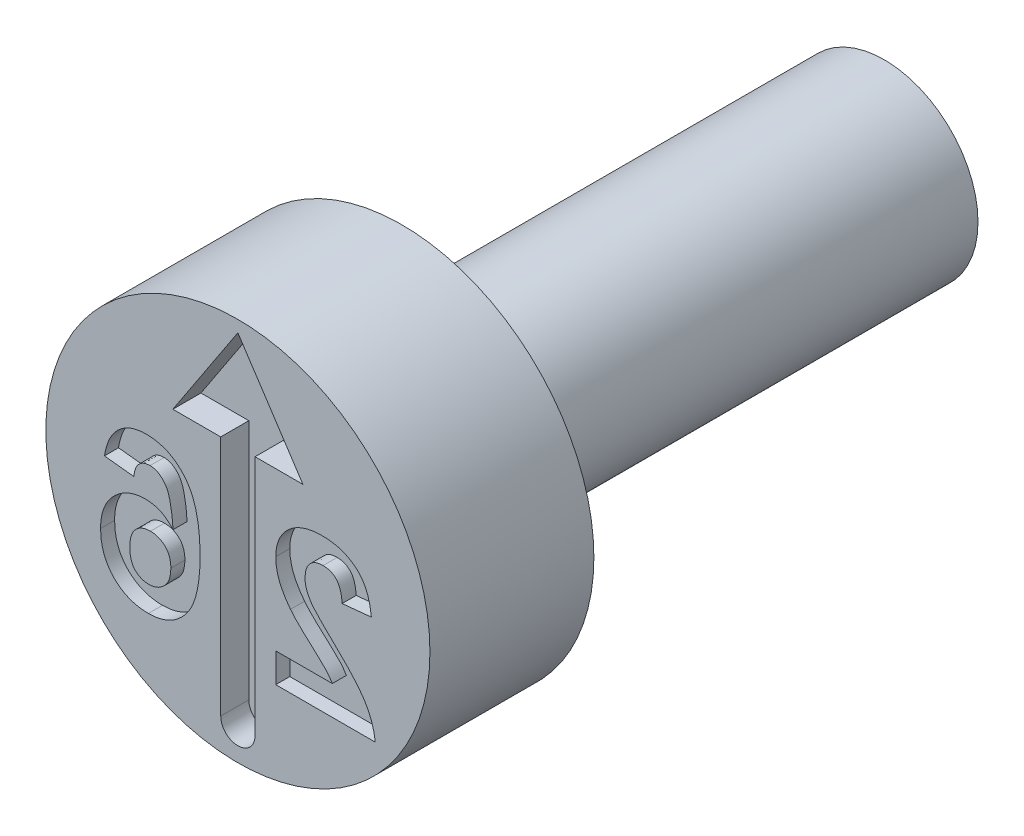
from build123d import *

# Parameters (mm, degrees)
CUT_EXTRUDE4_DEPTH = 0.6
CUT_EXTRUDE5_DEPTH = 0.3


with BuildPart() as part:
    # Sketch2 → Revolve1 (revolve)
    with BuildSketch(Plane(origin=(0, 0, 0), x_dir=(0, 0, -1), z_dir=(1, 0, 0)), mode=Mode.PRIVATE) as revolve1_sk:
        Polygon((0, 4.1), (0, 0), (13.8, 0), (13.8, 2), (3.5, 2), (3.5, 4.1), align=None)
    revolve(revolve1_sk.sketch.rotate(Axis((0, 0, -0.403888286), (0, 0, -1)), 90), axis=Axis((0, 0, -0.403888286), (0, 0, -1)))

    # Sketch3 → Cut-Extrude4 (cut)
    with BuildSketch(Plane.XY):
        with BuildLine():
            Line((0.366422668, 1.743593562), (0.366422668, -3.416891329))
            ThreePointArc((0.366422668, -3.416891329), (0, -3.783313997), (-0.366422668, -3.416891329))
            Line((-0.366422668, -3.416891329), (-0.366422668, 1.743593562))
            Line((-0.366422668, 1.743593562), (-1.388789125, 1.743593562))
            Line((-1.388789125, 1.743593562), (0, 3.851569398))
            Line((0, 3.851569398), (1.388789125, 1.743593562))
            Line((1.388789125, 1.743593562), (0.366422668, 1.743593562))
        make_face()
    extrude(amount=-CUT_EXTRUDE4_DEPTH, mode=Mode.SUBTRACT)

    # Sketch4 → Cut-Extrude5 (cut)
    # profile 1 of 2: a face of its own
    with BuildSketch(Plane.XY):
        with BuildLine():
            Line((0.808333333, -1.625), (0.808333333, -2.25))
            Line((0.808333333, -2.25), (2.933333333, -2.25))
            add(Edge.make_bspline(
                [(2.933333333, -2.25), (2.926138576, -2.196584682), (2.911753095, -2.089783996), (2.86727833, -1.933775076), (2.807919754, -1.781537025), (2.743497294, -1.657652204), (2.679422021, -1.557929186), (2.621286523, -1.476215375), (2.551933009, -1.389275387), (2.472367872, -1.296407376), (2.383030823, -1.197321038), (2.283255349, -1.092384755), (2.172565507, -0.982100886), (2.094693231, -0.907212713), (2.054427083, -0.868489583)],
                knots=[0, 0, 0, 0, 1.156289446, 2.311930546, 3.473459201, 4.661751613, 5.303057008, 6.018253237, 6.81459331, 7.690699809, 8.644447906, 9.679642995, 10.800191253, 12, 12, 12, 12], degree=3))
            add(Edge.make_bspline(
                [(2.054427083, -0.868489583), (2.022294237, -0.837472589), (1.961122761, -0.778425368), (1.874014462, -0.693872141), (1.79743729, -0.616143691), (1.729790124, -0.547254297), (1.672635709, -0.48544986), (1.625222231, -0.431701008), (1.586949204, -0.385788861), (1.5662205, -0.356662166), (1.55703125, -0.34375)],
                knots=[0, 0, 0, 0, 1.480720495, 2.818855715, 4.024636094, 5.098235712, 6.019786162, 6.815086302, 7.474715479, 8, 8, 8, 8], degree=3))
            add(Edge.make_bspline(
                [(1.55703125, -0.34375), (1.53821391, -0.312492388), (1.501917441, -0.252200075), (1.462115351, -0.157389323), (1.438224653, -0.062598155), (1.434946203, 0.000740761), (1.433333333, 0.031901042)],
                knots=[0, 0, 0, 0, 1.0911822, 2.104764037, 3.067617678, 4, 4, 4, 4], degree=3))
            add(Edge.make_bspline(
                [(1.433333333, 0.031901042), (1.434503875, 0.064327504), (1.436718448, 0.12567584), (1.455288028, 0.212249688), (1.488218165, 0.286672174), (1.533556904, 0.349171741), (1.59088783, 0.398139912), (1.657909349, 0.434322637), (1.73560255, 0.454326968), (1.790209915, 0.456958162), (1.81875, 0.458333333)],
                knots=[0, 0, 0, 0, 1.193122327, 2.257294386, 3.237245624, 4.168877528, 5.075331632, 5.990371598, 6.949684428, 8, 8, 8, 8], degree=3))
            add(Edge.make_bspline(
                [(1.81875, 0.458333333), (1.847097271, 0.457049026), (1.901858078, 0.454568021), (1.979685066, 0.432894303), (2.047769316, 0.395374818), (2.096289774, 0.352617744), (2.129067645, 0.311039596), (2.151401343, 0.274806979), (2.170651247, 0.233635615), (2.187708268, 0.187989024), (2.201181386, 0.137344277), (2.212031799, 0.082087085), (2.220775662, 0.021920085), (2.223556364, -0.019936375), (2.225, -0.041666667)],
                knots=[0, 0, 0, 0, 1.402788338, 2.709884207, 3.961032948, 5.225417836, 5.883680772, 6.578928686, 7.329201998, 8.132101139, 8.990263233, 9.922304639, 10.921339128, 12, 12, 12, 12], degree=3))
            Line((2.225, -0.041666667), (2.85, 0.01953125))
            add(Edge.make_bspline(
                [(2.85, 0.01953125), (2.844975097, 0.061726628), (2.835232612, 0.143536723), (2.810920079, 0.261044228), (2.780129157, 0.369450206), (2.741391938, 0.468553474), (2.696309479, 0.558984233), (2.6425822, 0.639385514), (2.582087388, 0.710647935), (2.514772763, 0.772733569), (2.441066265, 0.825839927), (2.363724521, 0.8732455), (2.281236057, 0.91213314), (2.194509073, 0.944182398), (2.103582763, 0.969795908), (2.008036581, 0.986731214), (1.908460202, 0.998643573), (1.84048895, 0.999541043), (1.805729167, 1)],
                knots=[0, 0, 0, 0, 1.270971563, 2.464210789, 3.586263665, 4.638946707, 5.643716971, 6.603612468, 7.52484387, 8.434700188, 9.336036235, 10.239171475, 11.145359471, 12.059630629, 13.003312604, 13.96741569, 14.960557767, 16, 16, 16, 16], degree=3))
            add(Edge.make_bspline(
                [(1.805729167, 1), (1.767940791, 0.999273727), (1.694343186, 0.997859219), (1.586903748, 0.986178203), (1.485972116, 0.965810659), (1.390665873, 0.938830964), (1.301963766, 0.902811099), (1.219126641, 0.859264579), (1.14345821, 0.806538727), (1.073830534, 0.747508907), (1.011588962, 0.682595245), (0.957070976, 0.61335385), (0.911395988, 0.539832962), (0.873067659, 0.462928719), (0.844609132, 0.381403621), (0.823873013, 0.296384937), (0.810124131, 0.207476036), (0.808936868, 0.146753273), (0.808333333, 0.115885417)],
                knots=[0, 0, 0, 0, 1.210756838, 2.35810096, 3.457354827, 4.507168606, 5.527358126, 6.519769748, 7.499700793, 8.476517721, 9.440526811, 10.376769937, 11.295256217, 12.209626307, 13.124630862, 14.055668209, 15.011616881, 16, 16, 16, 16], degree=3))
            add(Edge.make_bspline(
                [(0.808333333, 0.115885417), (0.809128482, 0.080458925), (0.810705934, 0.010178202), (0.82580887, -0.093717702), (0.848883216, -0.195217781), (0.882985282, -0.294570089), (0.926212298, -0.39415786), (0.981932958, -0.494204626), (1.046628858, -0.59772762), (1.097283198, -0.664659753), (1.1234375, -0.69921875)],
                knots=[0, 0, 0, 0, 0.953409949, 1.89141903, 2.821310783, 3.752688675, 4.715703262, 5.740811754, 6.833515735, 8, 8, 8, 8], degree=3))
            add(Edge.make_bspline(
                [(1.1234375, -0.69921875), (1.133322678, -0.711669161), (1.154494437, -0.738335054), (1.190513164, -0.779223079), (1.23225577, -0.823885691), (1.279132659, -0.873158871), (1.332692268, -0.925297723), (1.391007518, -0.982482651), (1.45664445, -1.041788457), (1.524628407, -1.104694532), (1.592907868, -1.165920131), (1.655666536, -1.224070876), (1.71267229, -1.275521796), (1.761270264, -1.323113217), (1.804318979, -1.36359706), (1.840266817, -1.399049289), (1.869786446, -1.428611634), (1.910462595, -1.474691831), (1.962218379, -1.537015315), (1.998630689, -1.596567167), (2.016015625, -1.625)],
                knots=[0, 0, 0, 0, 0.665555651, 1.425465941, 2.280616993, 3.225313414, 4.272635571, 5.410053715, 6.644756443, 7.976022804, 9.288331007, 10.484517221, 11.558462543, 12.503158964, 13.33222979, 14.032602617, 14.617328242, 15.080653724, 16.606167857, 18, 18, 18, 18], degree=3))
            Line((2.016015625, -1.625), (0.808333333, -1.625))
        make_face()
    # profile 2 of 2: a face of its own
    with BuildSketch(Plane.XY):
        with BuildLine():
            Line((-2.848333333, 0.151692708), (-2.223333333, 0.083333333))
            add(Edge.make_bspline(
                [(-2.223333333, 0.083333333), (-2.219146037, 0.113436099), (-2.21126631, 0.170084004), (-2.187926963, 0.248258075), (-2.155435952, 0.314022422), (-2.11373059, 0.367468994), (-2.06405511, 0.408603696), (-2.007452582, 0.43783241), (-1.943958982, 0.455183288), (-1.899443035, 0.457256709), (-1.876328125, 0.458333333)],
                knots=[0, 0, 0, 0, 1.280716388, 2.410074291, 3.425374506, 4.35753932, 5.248331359, 6.12451615, 7.026154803, 8, 8, 8, 8], degree=3))
            add(Edge.make_bspline(
                [(-1.876328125, 0.458333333), (-1.860653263, 0.457950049), (-1.82946108, 0.457187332), (-1.784025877, 0.447503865), (-1.740220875, 0.433133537), (-1.698403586, 0.412780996), (-1.658365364, 0.386519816), (-1.620714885, 0.354036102), (-1.583721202, 0.317042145), (-1.54956173, 0.272370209), (-1.516789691, 0.219475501), (-1.488571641, 0.154722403), (-1.463420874, 0.078171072), (-1.441886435, -0.010553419), (-1.422344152, -0.110887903), (-1.406325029, -0.223238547), (-1.393506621, -0.347706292), (-1.387357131, -0.434874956), (-1.384140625, -0.48046875)],
                knots=[0, 0, 0, 0, 0.642458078, 1.278459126, 1.898279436, 2.531842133, 3.181731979, 3.858193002, 4.57010051, 5.325711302, 6.161524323, 7.118599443, 8.217371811, 9.466325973, 10.864147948, 12.412648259, 14.123626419, 16, 16, 16, 16], degree=3))
            add(Edge.make_bspline(
                [(-1.384140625, -0.48046875), (-1.40411571, -0.458773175), (-1.443284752, -0.416230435), (-1.508278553, -0.360764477), (-1.57636923, -0.313344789), (-1.648297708, -0.274441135), (-1.724456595, -0.245490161), (-1.803466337, -0.223508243), (-1.886361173, -0.211195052), (-1.942696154, -0.209298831), (-1.971380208, -0.208333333)],
                knots=[0, 0, 0, 0, 1.057745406, 2.074127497, 3.059409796, 4.031705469, 5.000875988, 5.977809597, 6.970362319, 8, 8, 8, 8], degree=3))
            add(Edge.make_bspline(
                [(-1.971380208, -0.208333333), (-2.003752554, -0.209265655), (-2.067676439, -0.21110666), (-2.161851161, -0.224019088), (-2.252217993, -0.247237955), (-2.339185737, -0.278647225), (-2.423184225, -0.318199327), (-2.502606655, -0.368266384), (-2.578699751, -0.426642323), (-2.650417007, -0.493336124), (-2.716307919, -0.566760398), (-2.774483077, -0.646064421), (-2.822359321, -0.731490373), (-2.863287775, -0.821125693), (-2.893740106, -0.916739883), (-2.91584528, -1.016957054), (-2.929040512, -1.122697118), (-2.930777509, -1.194840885), (-2.931666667, -1.231770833)],
                knots=[0, 0, 0, 0, 0.99135015, 1.957564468, 2.903754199, 3.843479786, 4.78583385, 5.741106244, 6.712813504, 7.719198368, 8.735844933, 9.730198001, 10.724351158, 11.729813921, 12.742848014, 13.790983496, 14.86921809, 16, 16, 16, 16], degree=3))
            add(Edge.make_bspline(
                [(-2.931666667, -1.231770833), (-2.930764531, -1.270866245), (-2.92900515, -1.347111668), (-2.916054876, -1.458774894), (-2.89317919, -1.564172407), (-2.861926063, -1.664149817), (-2.821501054, -1.757914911), (-2.772529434, -1.846240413), (-2.713353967, -1.92761691), (-2.646660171, -2.003139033), (-2.572309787, -2.070532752), (-2.493073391, -2.130210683), (-2.408072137, -2.179819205), (-2.318562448, -2.22157327), (-2.223006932, -2.252215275), (-2.123090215, -2.275195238), (-2.017999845, -2.289210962), (-1.946249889, -2.290835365), (-1.90953125, -2.291666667)],
                knots=[0, 0, 0, 0, 1.13287417, 2.209376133, 3.25169942, 4.254157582, 5.240146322, 6.205890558, 7.174579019, 8.150183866, 9.1206468, 10.07783463, 11.019441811, 11.967766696, 12.934309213, 13.921380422, 14.936249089, 16, 16, 16, 16], degree=3))
            add(Edge.make_bspline(
                [(-1.90953125, -2.291666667), (-1.87018794, -2.29056595), (-1.792831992, -2.288401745), (-1.679591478, -2.270591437), (-1.571932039, -2.240459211), (-1.469867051, -2.198378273), (-1.372548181, -2.145446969), (-1.280879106, -2.079696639), (-1.195102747, -2.001754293), (-1.114084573, -1.91267545), (-1.040360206, -1.809782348), (-0.977575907, -1.690859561), (-0.92432853, -1.55720953), (-0.880977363, -1.408489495), (-0.847513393, -1.244711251), (-0.824162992, -1.065861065), (-0.808653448, -0.872234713), (-0.807344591, -0.738096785), (-0.806666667, -0.668619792)],
                knots=[0, 0, 0, 0, 0.852151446, 1.675481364, 2.476404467, 3.269281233, 4.062617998, 4.871616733, 5.707301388, 6.56955125, 7.476395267, 8.442009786, 9.475854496, 10.58877921, 11.794095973, 13.094195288, 14.494932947, 16, 16, 16, 16], degree=3))
            add(Edge.make_bspline(
                [(-0.806666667, -0.668619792), (-0.807638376, -0.597410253), (-0.809515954, -0.459816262), (-0.824624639, -0.261149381), (-0.848623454, -0.07768896), (-0.883583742, 0.090151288), (-0.928300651, 0.242719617), (-0.982512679, 0.380322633), (-1.047581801, 0.502462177), (-1.123234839, 0.608741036), (-1.206474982, 0.70112534), (-1.295916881, 0.780868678), (-1.391219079, 0.848742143), (-1.492379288, 0.904574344), (-1.60022795, 0.946900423), (-1.713742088, 0.977465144), (-1.833112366, 0.997108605), (-1.914879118, 0.999026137), (-1.95640625, 1)],
                knots=[0, 0, 0, 0, 1.491699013, 2.882321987, 4.171520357, 5.365488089, 6.470299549, 7.49861535, 8.458736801, 9.361983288, 10.224742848, 11.058789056, 11.867429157, 12.671146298, 13.473202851, 14.288259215, 15.130652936, 16, 16, 16, 16], degree=3))
            add(Edge.make_bspline(
                [(-1.95640625, 1), (-1.985738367, 0.9994723), (-2.043078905, 0.998440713), (-2.127119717, 0.987486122), (-2.20729387, 0.970734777), (-2.283811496, 0.947547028), (-2.356133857, 0.916494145), (-2.424548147, 0.878664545), (-2.48928436, 0.83416068), (-2.55000567, 0.783269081), (-2.606223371, 0.725835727), (-2.656986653, 0.661730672), (-2.702631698, 0.591727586), (-2.743358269, 0.515884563), (-2.777519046, 0.433475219), (-2.806885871, 0.345147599), (-2.831038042, 0.250711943), (-2.842480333, 0.185202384), (-2.848333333, 0.151692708)],
                knots=[0, 0, 0, 0, 1.036027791, 2.025301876, 2.989435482, 3.928225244, 4.845595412, 5.765526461, 6.686607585, 7.61747015, 8.561102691, 9.521661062, 10.50224679, 11.510949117, 12.559251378, 13.650572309, 14.798212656, 16, 16, 16, 16], degree=3))
        make_face()
        with BuildLine():
            add(Edge.make_bspline(
                [(-1.431666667, -1.217447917), (-1.431903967, -1.238089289), (-1.432367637, -1.278421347), (-1.439970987, -1.336946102), (-1.450900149, -1.391812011), (-1.465621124, -1.44332375), (-1.486025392, -1.490701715), (-1.510233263, -1.534896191), (-1.538867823, -1.575506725), (-1.582804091, -1.62315474), (-1.64351563, -1.673199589), (-1.723190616, -1.717764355), (-1.808560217, -1.745466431), (-1.867445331, -1.748479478), (-1.897161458, -1.75)],
                knots=[0, 0, 0, 0, 0.93816693, 1.833124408, 2.679057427, 3.481731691, 4.264557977, 5.020023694, 5.770442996, 6.518065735, 7.962605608, 9.32780964, 10.651490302, 12, 12, 12, 12], degree=3))
            add(Edge.make_bspline(
                [(-1.897161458, -1.75), (-1.925311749, -1.748736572), (-1.980103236, -1.746277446), (-2.058346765, -1.723802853), (-2.12941919, -1.688358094), (-2.181520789, -1.646745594), (-2.217850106, -1.606272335), (-2.242262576, -1.570778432), (-2.262134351, -1.530288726), (-2.278380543, -1.485470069), (-2.29146673, -1.43649582), (-2.300401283, -1.382873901), (-2.305469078, -1.324751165), (-2.306257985, -1.284515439), (-2.306666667, -1.263671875)],
                knots=[0, 0, 0, 0, 1.399678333, 2.724321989, 4.020062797, 5.33532049, 6.016755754, 6.724441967, 7.473839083, 8.257094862, 9.096253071, 9.995581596, 10.961638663, 12, 12, 12, 12], degree=3))
            add(Edge.make_bspline(
                [(-2.306666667, -1.263671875), (-2.306318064, -1.242173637), (-2.305644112, -1.20061108), (-2.299746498, -1.140539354), (-2.290098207, -1.085005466), (-2.276609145, -1.033617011), (-2.258350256, -0.987061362), (-2.236809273, -0.944399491), (-2.210656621, -0.906788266), (-2.171789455, -0.862552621), (-2.115275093, -0.817979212), (-2.039761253, -0.777379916), (-1.955118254, -0.754363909), (-1.896210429, -0.751482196), (-1.865911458, -0.75)],
                knots=[0, 0, 0, 0, 1.008384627, 1.949510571, 2.828269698, 3.650667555, 4.437180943, 5.170285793, 5.887596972, 6.580056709, 7.926803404, 9.238379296, 10.579573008, 12, 12, 12, 12], degree=3))
            add(Edge.make_bspline(
                [(-1.865911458, -0.75), (-1.836453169, -0.751199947), (-1.779240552, -0.753530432), (-1.697019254, -0.776933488), (-1.621785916, -0.81417179), (-1.566372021, -0.857919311), (-1.527315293, -0.899149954), (-1.501734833, -0.934254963), (-1.479468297, -0.972475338), (-1.46188388, -1.014799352), (-1.448326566, -1.060432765), (-1.438602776, -1.109687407), (-1.432718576, -1.162399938), (-1.432023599, -1.198769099), (-1.431666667, -1.217447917)],
                knots=[0, 0, 0, 0, 1.469034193, 2.853094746, 4.235454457, 5.641396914, 6.354997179, 7.06867986, 7.807229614, 8.560602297, 9.353235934, 10.182779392, 11.06669468, 12, 12, 12, 12], degree=3))
        make_face(mode=Mode.SUBTRACT)
    extrude(amount=-CUT_EXTRUDE5_DEPTH, mode=Mode.SUBTRACT)


solid = part.part
